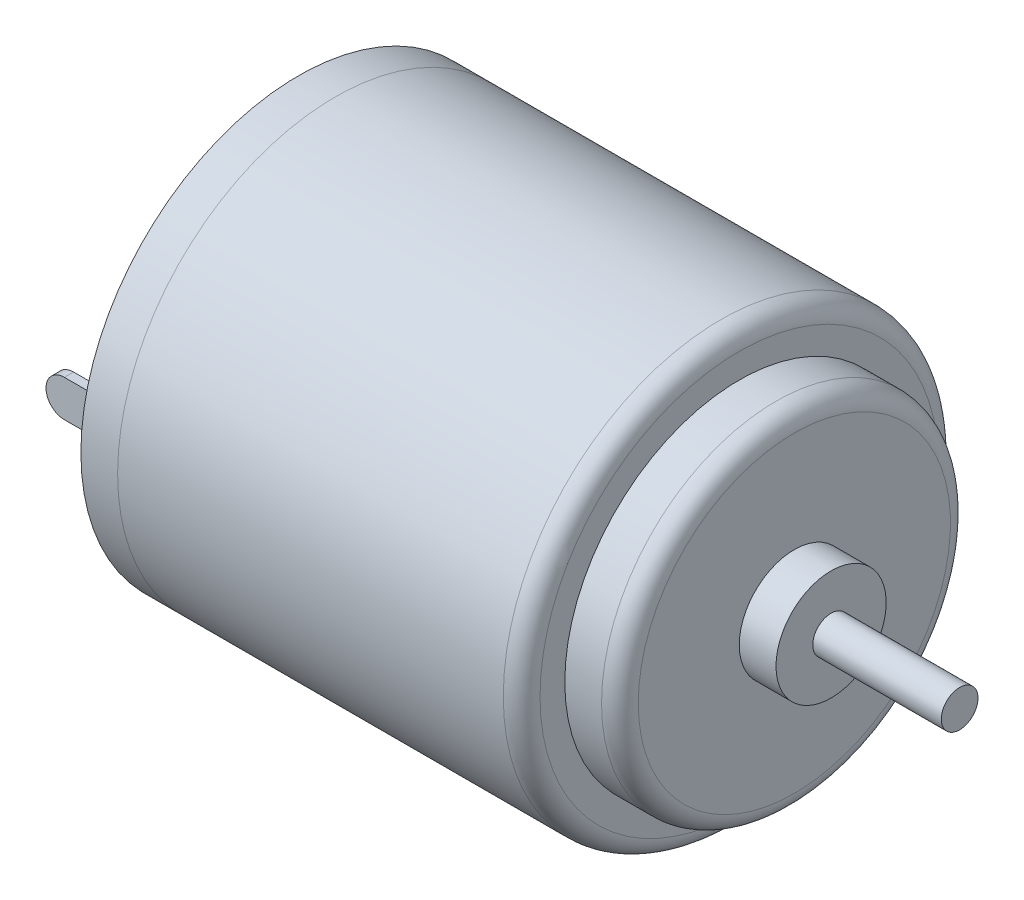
ISO-10303-21;
HEADER;
FILE_DESCRIPTION(('STEP AP214'),'2;1');
FILE_NAME('part.step','',(''),(''),'','','');
FILE_SCHEMA(('AUTOMOTIVE_DESIGN { 1 0 10303 214 1 1 1 1 }'));
ENDSEC;
DATA;
#1=APPLICATION_CONTEXT('core data for automotive mechanical design processes');
#2=APPLICATION_PROTOCOL_DEFINITION('international standard','automotive_design',2000,#1);
#3=PRODUCT_CONTEXT('',#1,'mechanical');
#4=PRODUCT('Part','Part','',(#3));
#5=PRODUCT_RELATED_PRODUCT_CATEGORY('part','',(#4));
#6=PRODUCT_DEFINITION_FORMATION('','',#4);
#7=PRODUCT_DEFINITION_CONTEXT('part definition',#1,'design');
#8=PRODUCT_DEFINITION('design','',#6,#7);
#9=PRODUCT_DEFINITION_SHAPE('','',#8);
#10=(LENGTH_UNIT() NAMED_UNIT(*) SI_UNIT(.MILLI.,.METRE.));
#11=(NAMED_UNIT(*) PLANE_ANGLE_UNIT() SI_UNIT($,.RADIAN.));
#12=(NAMED_UNIT(*) SI_UNIT($,.STERADIAN.) SOLID_ANGLE_UNIT());
#13=UNCERTAINTY_MEASURE_WITH_UNIT(LENGTH_MEASURE(1.E-05),#10,'distance_accuracy_value','');
#14=(GEOMETRIC_REPRESENTATION_CONTEXT(3) GLOBAL_UNCERTAINTY_ASSIGNED_CONTEXT((#13)) GLOBAL_UNIT_ASSIGNED_CONTEXT((#10,
#11,#12)) REPRESENTATION_CONTEXT('',''));
#15=CARTESIAN_POINT('',(0.,0.,0.));
#16=DIRECTION('',(0.,0.,1.));
#17=DIRECTION('',(1.,0.,0.));
#18=AXIS2_PLACEMENT_3D('',#15,#16,#17);
#19=CARTESIAN_POINT('',(34.,0.,0.));
#20=DIRECTION('',(-1.,0.,0.));
#21=DIRECTION('',(0.,0.,1.));
#22=AXIS2_PLACEMENT_3D('',#19,#20,#21);
#23=CYLINDRICAL_SURFACE('',#22,1.);
#24=CARTESIAN_POINT('',(34.,0.,0.));
#25=DIRECTION('',(1.,0.,0.));
#26=DIRECTION('',(0.,0.,-1.));
#27=AXIS2_PLACEMENT_3D('',#24,#25,#26);
#28=CIRCLE('',#27,1.);
#29=CARTESIAN_POINT('',(34.,0.,-1.));
#30=VERTEX_POINT('',#29);
#31=EDGE_CURVE('E11',#30,#30,#28,.T.);
#32=ORIENTED_EDGE('',*,*,#31,.F.);
#33=EDGE_LOOP('',(#32));
#34=FACE_BOUND('',#33,.T.);
#35=CARTESIAN_POINT('',(-5.,0.,0.));
#36=DIRECTION('',(1.,0.,0.));
#37=DIRECTION('',(0.,0.,-1.));
#38=AXIS2_PLACEMENT_3D('',#35,#36,#37);
#39=CIRCLE('',#38,1.);
#40=CARTESIAN_POINT('',(-5.,0.,-1.));
#41=VERTEX_POINT('',#40);
#42=EDGE_CURVE('E45',#41,#41,#39,.T.);
#43=ORIENTED_EDGE('',*,*,#42,.T.);
#44=EDGE_LOOP('',(#43));
#45=FACE_BOUND('',#44,.T.);
#46=ADVANCED_FACE('F39',(#34,#45),#23,.T.);
#47=CARTESIAN_POINT('',(34.,0.,0.));
#48=DIRECTION('',(1.,0.,0.));
#49=DIRECTION('',(0.,0.,-1.));
#50=AXIS2_PLACEMENT_3D('',#47,#48,#49);
#51=PLANE('',#50);
#52=ORIENTED_EDGE('',*,*,#31,.T.);
#53=EDGE_LOOP('',(#52));
#54=FACE_BOUND('',#53,.T.);
#55=ADVANCED_FACE('F54',(#54),#51,.T.);
#56=CARTESIAN_POINT('',(-5.,0.,0.));
#57=DIRECTION('',(1.,0.,0.));
#58=DIRECTION('',(0.,0.,-1.));
#59=AXIS2_PLACEMENT_3D('',#56,#57,#58);
#60=PLANE('',#59);
#61=ORIENTED_EDGE('',*,*,#42,.F.);
#62=EDGE_LOOP('',(#61));
#63=FACE_BOUND('',#62,.T.);
#64=ADVANCED_FACE('F52',(#63),#60,.F.);
#65=CLOSED_SHELL('',(#46,#55,#64));
#66=MANIFOLD_SOLID_BREP('B2',#65);
#67=CARTESIAN_POINT('',(0.,0.,0.));
#68=DIRECTION('',(-1.,0.,0.));
#69=DIRECTION('',(0.,0.,1.));
#70=AXIS2_PLACEMENT_3D('',#67,#68,#69);
#71=PLANE('',#70);
#72=CARTESIAN_POINT('',(0.,0.,0.));
#73=DIRECTION('',(-1.,0.,0.));
#74=DIRECTION('',(0.,0.,1.));
#75=AXIS2_PLACEMENT_3D('',#72,#73,#74);
#76=CIRCLE('',#75,11.85);
#77=CARTESIAN_POINT('',(0.,0.,11.85));
#78=VERTEX_POINT('',#77);
#79=EDGE_CURVE('E37',#78,#78,#76,.T.);
#80=ORIENTED_EDGE('',*,*,#79,.F.);
#81=EDGE_LOOP('',(#80));
#82=FACE_BOUND('',#81,.T.);
#83=ADVANCED_FACE('F86',(#82),#71,.F.);
#84=CARTESIAN_POINT('',(-4.,0.,0.));
#85=DIRECTION('',(-1.,0.,0.));
#86=DIRECTION('',(0.,0.,1.));
#87=AXIS2_PLACEMENT_3D('',#84,#85,#86);
#88=CYLINDRICAL_SURFACE('',#87,11.85);
#89=CARTESIAN_POINT('',(-2.,0.,0.));
#90=DIRECTION('',(-1.,0.,0.));
#91=DIRECTION('',(0.,0.,1.));
#92=AXIS2_PLACEMENT_3D('',#89,#90,#91);
#93=CIRCLE('',#92,11.85);
#94=CARTESIAN_POINT('',(-2.,0.,11.85));
#95=VERTEX_POINT('',#94);
#96=EDGE_CURVE('E93',#95,#95,#93,.T.);
#97=ORIENTED_EDGE('',*,*,#96,.F.);
#98=EDGE_LOOP('',(#97));
#99=FACE_BOUND('',#98,.T.);
#100=ORIENTED_EDGE('',*,*,#79,.T.);
#101=EDGE_LOOP('',(#100));
#102=FACE_BOUND('',#101,.T.);
#103=ADVANCED_FACE('F226',(#99,#102),#88,.T.);
#104=CARTESIAN_POINT('',(-2.,11.85,0.));
#105=DIRECTION('',(1.,0.,0.));
#106=DIRECTION('',(0.,0.,-1.));
#107=AXIS2_PLACEMENT_3D('',#104,#105,#106);
#108=PLANE('',#107);
#109=DIRECTION('',(0.,0.,1.));
#110=VECTOR('',#109,1.);
#111=CARTESIAN_POINT('',(-2.,-1.,-9.75));
#112=LINE('',#111,#110);
#113=CARTESIAN_POINT('',(-2.,-1.,-9.75));
#114=VERTEX_POINT('',#113);
#115=CARTESIAN_POINT('',(-2.,-1.,-9.25));
#116=VERTEX_POINT('',#115);
#117=EDGE_CURVE('E100',#114,#116,#112,.T.);
#118=ORIENTED_EDGE('',*,*,#117,.F.);
#119=DIRECTION('',(0.,1.,0.));
#120=VECTOR('',#119,1.);
#121=CARTESIAN_POINT('',(-2.,-1.,-9.75));
#122=LINE('',#121,#120);
#123=CARTESIAN_POINT('',(-2.,0.999999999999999,-9.75));
#124=VERTEX_POINT('',#123);
#125=EDGE_CURVE('E104',#114,#124,#122,.T.);
#126=ORIENTED_EDGE('',*,*,#125,.T.);
#127=DIRECTION('',(0.,0.,1.));
#128=VECTOR('',#127,1.);
#129=CARTESIAN_POINT('',(-2.,1.,-9.75));
#130=LINE('',#129,#128);
#131=CARTESIAN_POINT('',(-2.,1.,-9.25));
#132=VERTEX_POINT('',#131);
#133=EDGE_CURVE('E182',#124,#132,#130,.T.);
#134=ORIENTED_EDGE('',*,*,#133,.T.);
#135=DIRECTION('',(0.,1.,0.));
#136=VECTOR('',#135,1.);
#137=CARTESIAN_POINT('',(-2.,-1.,-9.25));
#138=LINE('',#137,#136);
#139=EDGE_CURVE('E166',#116,#132,#138,.T.);
#140=ORIENTED_EDGE('',*,*,#139,.F.);
#141=EDGE_LOOP('',(#118,#126,#134,#140));
#142=FACE_BOUND('',#141,.T.);
#143=DIRECTION('',(0.,0.,-1.));
#144=VECTOR('',#143,1.);
#145=CARTESIAN_POINT('',(-2.,1.,9.75));
#146=LINE('',#145,#144);
#147=CARTESIAN_POINT('',(-2.,0.999999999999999,9.75));
#148=VERTEX_POINT('',#147);
#149=CARTESIAN_POINT('',(-2.,0.999999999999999,9.25));
#150=VERTEX_POINT('',#149);
#151=EDGE_CURVE('E213',#148,#150,#146,.T.);
#152=ORIENTED_EDGE('',*,*,#151,.F.);
#153=DIRECTION('',(0.,1.,0.));
#154=VECTOR('',#153,1.);
#155=CARTESIAN_POINT('',(-2.,-1.,9.75));
#156=LINE('',#155,#154);
#157=CARTESIAN_POINT('',(-2.,-1.,9.75));
#158=VERTEX_POINT('',#157);
#159=EDGE_CURVE('E195',#158,#148,#156,.T.);
#160=ORIENTED_EDGE('',*,*,#159,.F.);
#161=DIRECTION('',(0.,0.,-1.));
#162=VECTOR('',#161,1.);
#163=CARTESIAN_POINT('',(-2.,-1.,9.75));
#164=LINE('',#163,#162);
#165=CARTESIAN_POINT('',(-2.,-1.,9.25));
#166=VERTEX_POINT('',#165);
#167=EDGE_CURVE('E205',#158,#166,#164,.T.);
#168=ORIENTED_EDGE('',*,*,#167,.T.);
#169=DIRECTION('',(0.,1.,0.));
#170=VECTOR('',#169,1.);
#171=CARTESIAN_POINT('',(-2.,-1.,9.25));
#172=LINE('',#171,#170);
#173=EDGE_CURVE('E186',#166,#150,#172,.T.);
#174=ORIENTED_EDGE('',*,*,#173,.T.);
#175=EDGE_LOOP('',(#152,#160,#168,#174));
#176=FACE_BOUND('',#175,.T.);
#177=CARTESIAN_POINT('',(-2.,0.,0.));
#178=DIRECTION('',(-1.,0.,0.));
#179=DIRECTION('',(0.,0.,1.));
#180=AXIS2_PLACEMENT_3D('',#177,#178,#179);
#181=CIRCLE('',#180,4.25);
#182=CARTESIAN_POINT('',(-2.,0.,4.25));
#183=VERTEX_POINT('',#182);
#184=EDGE_CURVE('E219',#183,#183,#181,.T.);
#185=ORIENTED_EDGE('',*,*,#184,.F.);
#186=EDGE_LOOP('',(#185));
#187=FACE_BOUND('',#186,.T.);
#188=ORIENTED_EDGE('',*,*,#96,.T.);
#189=EDGE_LOOP('',(#188));
#190=FACE_BOUND('',#189,.T.);
#191=ADVANCED_FACE('F224',(#142,#176,#187,#190),#108,.F.);
#192=CARTESIAN_POINT('',(-4.,0.,0.));
#193=DIRECTION('',(-1.,0.,0.));
#194=DIRECTION('',(0.,0.,1.));
#195=AXIS2_PLACEMENT_3D('',#192,#193,#194);
#196=CYLINDRICAL_SURFACE('',#195,4.25);
#197=CARTESIAN_POINT('',(-4.,0.,0.));
#198=DIRECTION('',(-1.,0.,0.));
#199=DIRECTION('',(0.,0.,1.));
#200=AXIS2_PLACEMENT_3D('',#197,#198,#199);
#201=CIRCLE('',#200,4.25);
#202=CARTESIAN_POINT('',(-4.,0.,4.25));
#203=VERTEX_POINT('',#202);
#204=EDGE_CURVE('E216',#203,#203,#201,.T.);
#205=ORIENTED_EDGE('',*,*,#204,.F.);
#206=EDGE_LOOP('',(#205));
#207=FACE_BOUND('',#206,.T.);
#208=ORIENTED_EDGE('',*,*,#184,.T.);
#209=EDGE_LOOP('',(#208));
#210=FACE_BOUND('',#209,.T.);
#211=ADVANCED_FACE('F245',(#207,#210),#196,.T.);
#212=CARTESIAN_POINT('',(-4.,4.25,0.));
#213=DIRECTION('',(1.,0.,0.));
#214=DIRECTION('',(0.,0.,-1.));
#215=AXIS2_PLACEMENT_3D('',#212,#213,#214);
#216=PLANE('',#215);
#217=ORIENTED_EDGE('',*,*,#204,.T.);
#218=EDGE_LOOP('',(#217));
#219=FACE_BOUND('',#218,.T.);
#220=ADVANCED_FACE('F253',(#219),#216,.F.);
#221=CARTESIAN_POINT('',(-2.,1.,9.75));
#222=DIRECTION('',(0.,-1.,0.));
#223=DIRECTION('',(1.,0.,0.));
#224=AXIS2_PLACEMENT_3D('',#221,#222,#223);
#225=PLANE('',#224);
#226=DIRECTION('',(-1.,0.,0.));
#227=VECTOR('',#226,1.);
#228=CARTESIAN_POINT('',(-2.,1.,9.25));
#229=LINE('',#228,#227);
#230=CARTESIAN_POINT('',(-5.,0.999999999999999,9.25));
#231=VERTEX_POINT('',#230);
#232=EDGE_CURVE('E188',#150,#231,#229,.T.);
#233=ORIENTED_EDGE('',*,*,#232,.T.);
#234=DIRECTION('',(0.,0.,-1.));
#235=VECTOR('',#234,1.);
#236=CARTESIAN_POINT('',(-5.,0.999999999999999,9.75));
#237=LINE('',#236,#235);
#238=CARTESIAN_POINT('',(-5.,0.999999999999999,9.75));
#239=VERTEX_POINT('',#238);
#240=EDGE_CURVE('E210',#239,#231,#237,.T.);
#241=ORIENTED_EDGE('',*,*,#240,.F.);
#242=DIRECTION('',(-1.,0.,0.));
#243=VECTOR('',#242,1.);
#244=CARTESIAN_POINT('',(-2.,1.,9.75));
#245=LINE('',#244,#243);
#246=EDGE_CURVE('E198',#148,#239,#245,.T.);
#247=ORIENTED_EDGE('',*,*,#246,.F.);
#248=ORIENTED_EDGE('',*,*,#151,.T.);
#249=EDGE_LOOP('',(#233,#241,#247,#248));
#250=FACE_BOUND('',#249,.T.);
#251=ADVANCED_FACE('F261',(#250),#225,.F.);
#252=CARTESIAN_POINT('',(-5.,0.,9.75));
#253=DIRECTION('',(0.,0.,-1.));
#254=DIRECTION('',(-1.,0.,0.));
#255=AXIS2_PLACEMENT_3D('',#252,#253,#254);
#256=CYLINDRICAL_SURFACE('',#255,1.);
#257=CARTESIAN_POINT('',(-5.,0.,9.25));
#258=DIRECTION('',(0.,0.,1.));
#259=DIRECTION('',(1.,0.,0.));
#260=AXIS2_PLACEMENT_3D('',#257,#258,#259);
#261=CIRCLE('',#260,1.);
#262=CARTESIAN_POINT('',(-5.,-1.,9.25));
#263=VERTEX_POINT('',#262);
#264=EDGE_CURVE('E190',#231,#263,#261,.T.);
#265=ORIENTED_EDGE('',*,*,#264,.T.);
#266=DIRECTION('',(0.,0.,-1.));
#267=VECTOR('',#266,1.);
#268=CARTESIAN_POINT('',(-5.,-1.,9.75));
#269=LINE('',#268,#267);
#270=CARTESIAN_POINT('',(-5.,-1.,9.75));
#271=VERTEX_POINT('',#270);
#272=EDGE_CURVE('E207',#271,#263,#269,.T.);
#273=ORIENTED_EDGE('',*,*,#272,.F.);
#274=CARTESIAN_POINT('',(-5.,0.,9.75));
#275=DIRECTION('',(0.,0.,1.));
#276=DIRECTION('',(1.,0.,0.));
#277=AXIS2_PLACEMENT_3D('',#274,#275,#276);
#278=CIRCLE('',#277,1.);
#279=EDGE_CURVE('E200',#239,#271,#278,.T.);
#280=ORIENTED_EDGE('',*,*,#279,.F.);
#281=ORIENTED_EDGE('',*,*,#240,.T.);
#282=EDGE_LOOP('',(#265,#273,#280,#281));
#283=FACE_BOUND('',#282,.T.);
#284=ADVANCED_FACE('F269',(#283),#256,.T.);
#285=CARTESIAN_POINT('',(-2.,-1.,9.75));
#286=DIRECTION('',(0.,1.,0.));
#287=DIRECTION('',(-1.,0.,0.));
#288=AXIS2_PLACEMENT_3D('',#285,#286,#287);
#289=PLANE('',#288);
#290=DIRECTION('',(1.,0.,0.));
#291=VECTOR('',#290,1.);
#292=CARTESIAN_POINT('',(-2.,-1.,9.25));
#293=LINE('',#292,#291);
#294=EDGE_CURVE('E192',#263,#166,#293,.T.);
#295=ORIENTED_EDGE('',*,*,#294,.T.);
#296=ORIENTED_EDGE('',*,*,#167,.F.);
#297=DIRECTION('',(1.,0.,0.));
#298=VECTOR('',#297,1.);
#299=CARTESIAN_POINT('',(-2.,-1.,9.75));
#300=LINE('',#299,#298);
#301=EDGE_CURVE('E202',#271,#158,#300,.T.);
#302=ORIENTED_EDGE('',*,*,#301,.F.);
#303=ORIENTED_EDGE('',*,*,#272,.T.);
#304=EDGE_LOOP('',(#295,#296,#302,#303));
#305=FACE_BOUND('',#304,.T.);
#306=ADVANCED_FACE('F277',(#305),#289,.F.);
#307=CARTESIAN_POINT('',(-5.,0.,9.75));
#308=DIRECTION('',(0.,0.,1.));
#309=DIRECTION('',(1.,0.,0.));
#310=AXIS2_PLACEMENT_3D('',#307,#308,#309);
#311=PLANE('',#310);
#312=ORIENTED_EDGE('',*,*,#159,.T.);
#313=ORIENTED_EDGE('',*,*,#246,.T.);
#314=ORIENTED_EDGE('',*,*,#279,.T.);
#315=ORIENTED_EDGE('',*,*,#301,.T.);
#316=EDGE_LOOP('',(#312,#313,#314,#315));
#317=FACE_BOUND('',#316,.T.);
#318=ADVANCED_FACE('F285',(#317),#311,.T.);
#319=CARTESIAN_POINT('',(-5.,0.,9.25));
#320=DIRECTION('',(0.,0.,1.));
#321=DIRECTION('',(1.,0.,0.));
#322=AXIS2_PLACEMENT_3D('',#319,#320,#321);
#323=PLANE('',#322);
#324=ORIENTED_EDGE('',*,*,#173,.F.);
#325=ORIENTED_EDGE('',*,*,#294,.F.);
#326=ORIENTED_EDGE('',*,*,#264,.F.);
#327=ORIENTED_EDGE('',*,*,#232,.F.);
#328=EDGE_LOOP('',(#324,#325,#326,#327));
#329=FACE_BOUND('',#328,.T.);
#330=ADVANCED_FACE('F293',(#329),#323,.F.);
#331=CARTESIAN_POINT('',(-2.,-1.,-9.75));
#332=DIRECTION('',(0.,-1.,0.));
#333=DIRECTION('',(1.,0.,0.));
#334=AXIS2_PLACEMENT_3D('',#331,#332,#333);
#335=PLANE('',#334);
#336=DIRECTION('',(1.,0.,0.));
#337=VECTOR('',#336,1.);
#338=CARTESIAN_POINT('',(-2.,-1.,-9.25));
#339=LINE('',#338,#337);
#340=CARTESIAN_POINT('',(-5.,-1.,-9.25));
#341=VERTEX_POINT('',#340);
#342=EDGE_CURVE('E162',#341,#116,#339,.T.);
#343=ORIENTED_EDGE('',*,*,#342,.F.);
#344=DIRECTION('',(0.,0.,1.));
#345=VECTOR('',#344,1.);
#346=CARTESIAN_POINT('',(-5.,-1.,-9.75));
#347=LINE('',#346,#345);
#348=CARTESIAN_POINT('',(-5.,-1.,-9.75));
#349=VERTEX_POINT('',#348);
#350=EDGE_CURVE('E148',#349,#341,#347,.T.);
#351=ORIENTED_EDGE('',*,*,#350,.F.);
#352=DIRECTION('',(1.,0.,0.));
#353=VECTOR('',#352,1.);
#354=CARTESIAN_POINT('',(-2.,-1.,-9.75));
#355=LINE('',#354,#353);
#356=EDGE_CURVE('E176',#349,#114,#355,.T.);
#357=ORIENTED_EDGE('',*,*,#356,.T.);
#358=ORIENTED_EDGE('',*,*,#117,.T.);
#359=EDGE_LOOP('',(#343,#351,#357,#358));
#360=FACE_BOUND('',#359,.T.);
#361=ADVANCED_FACE('F163',(#360),#335,.T.);
#362=CARTESIAN_POINT('',(-5.,0.,-9.75));
#363=DIRECTION('',(0.,0.,1.));
#364=DIRECTION('',(1.,0.,0.));
#365=AXIS2_PLACEMENT_3D('',#362,#363,#364);
#366=CYLINDRICAL_SURFACE('',#365,1.);
#367=CARTESIAN_POINT('',(-5.,0.,-9.25));
#368=DIRECTION('',(0.,0.,1.));
#369=DIRECTION('',(1.,0.,0.));
#370=AXIS2_PLACEMENT_3D('',#367,#368,#369);
#371=CIRCLE('',#370,1.);
#372=CARTESIAN_POINT('',(-5.,0.999999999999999,-9.25));
#373=VERTEX_POINT('',#372);
#374=EDGE_CURVE('E152',#373,#341,#371,.T.);
#375=ORIENTED_EDGE('',*,*,#374,.F.);
#376=DIRECTION('',(0.,0.,1.));
#377=VECTOR('',#376,1.);
#378=CARTESIAN_POINT('',(-5.,0.999999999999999,-9.75));
#379=LINE('',#378,#377);
#380=CARTESIAN_POINT('',(-5.,0.999999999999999,-9.75));
#381=VERTEX_POINT('',#380);
#382=EDGE_CURVE('E159',#381,#373,#379,.T.);
#383=ORIENTED_EDGE('',*,*,#382,.F.);
#384=CARTESIAN_POINT('',(-5.,0.,-9.75));
#385=DIRECTION('',(0.,0.,1.));
#386=DIRECTION('',(1.,0.,0.));
#387=AXIS2_PLACEMENT_3D('',#384,#385,#386);
#388=CIRCLE('',#387,1.);
#389=EDGE_CURVE('E155',#381,#349,#388,.T.);
#390=ORIENTED_EDGE('',*,*,#389,.T.);
#391=ORIENTED_EDGE('',*,*,#350,.T.);
#392=EDGE_LOOP('',(#375,#383,#390,#391));
#393=FACE_BOUND('',#392,.T.);
#394=ADVANCED_FACE('F150',(#393),#366,.T.);
#395=CARTESIAN_POINT('',(-2.,1.,-9.75));
#396=DIRECTION('',(0.,1.,0.));
#397=DIRECTION('',(-1.,0.,0.));
#398=AXIS2_PLACEMENT_3D('',#395,#396,#397);
#399=PLANE('',#398);
#400=DIRECTION('',(-1.,0.,0.));
#401=VECTOR('',#400,1.);
#402=CARTESIAN_POINT('',(-2.,1.,-9.25));
#403=LINE('',#402,#401);
#404=EDGE_CURVE('E170',#132,#373,#403,.T.);
#405=ORIENTED_EDGE('',*,*,#404,.F.);
#406=ORIENTED_EDGE('',*,*,#133,.F.);
#407=DIRECTION('',(-1.,0.,0.));
#408=VECTOR('',#407,1.);
#409=CARTESIAN_POINT('',(-2.,1.,-9.75));
#410=LINE('',#409,#408);
#411=EDGE_CURVE('E179',#124,#381,#410,.T.);
#412=ORIENTED_EDGE('',*,*,#411,.T.);
#413=ORIENTED_EDGE('',*,*,#382,.T.);
#414=EDGE_LOOP('',(#405,#406,#412,#413));
#415=FACE_BOUND('',#414,.T.);
#416=ADVANCED_FACE('F312',(#415),#399,.T.);
#417=CARTESIAN_POINT('',(-5.,0.,-9.75));
#418=DIRECTION('',(0.,0.,-1.));
#419=DIRECTION('',(1.,0.,0.));
#420=AXIS2_PLACEMENT_3D('',#417,#418,#419);
#421=PLANE('',#420);
#422=ORIENTED_EDGE('',*,*,#125,.F.);
#423=ORIENTED_EDGE('',*,*,#356,.F.);
#424=ORIENTED_EDGE('',*,*,#389,.F.);
#425=ORIENTED_EDGE('',*,*,#411,.F.);
#426=EDGE_LOOP('',(#422,#423,#424,#425));
#427=FACE_BOUND('',#426,.T.);
#428=ADVANCED_FACE('F319',(#427),#421,.T.);
#429=CARTESIAN_POINT('',(-5.,0.,-9.25));
#430=DIRECTION('',(0.,0.,-1.));
#431=DIRECTION('',(1.,0.,0.));
#432=AXIS2_PLACEMENT_3D('',#429,#430,#431);
#433=PLANE('',#432);
#434=ORIENTED_EDGE('',*,*,#139,.T.);
#435=ORIENTED_EDGE('',*,*,#404,.T.);
#436=ORIENTED_EDGE('',*,*,#374,.T.);
#437=ORIENTED_EDGE('',*,*,#342,.T.);
#438=EDGE_LOOP('',(#434,#435,#436,#437));
#439=FACE_BOUND('',#438,.T.);
#440=ADVANCED_FACE('F168',(#439),#433,.F.);
#441=CLOSED_SHELL('',(#83,#103,#191,#211,#220,#251,#284,#306,#318,#330,#361,#394,#416,#428,#440));
#442=MANIFOLD_SOLID_BREP('B6',#441);
#443=CARTESIAN_POINT('',(0.,11.85,0.));
#444=DIRECTION('',(1.,0.,0.));
#445=DIRECTION('',(0.,0.,-1.));
#446=AXIS2_PLACEMENT_3D('',#443,#444,#445);
#447=PLANE('',#446);
#448=CARTESIAN_POINT('',(0.,0.,0.));
#449=DIRECTION('',(-1.,0.,0.));
#450=DIRECTION('',(0.,0.,1.));
#451=AXIS2_PLACEMENT_3D('',#448,#449,#450);
#452=CIRCLE('',#451,11.85);
#453=CARTESIAN_POINT('',(0.,0.,11.85));
#454=VERTEX_POINT('',#453);
#455=EDGE_CURVE('E403',#454,#454,#452,.T.);
#456=ORIENTED_EDGE('',*,*,#455,.T.);
#457=EDGE_LOOP('',(#456));
#458=FACE_BOUND('',#457,.T.);
#459=ADVANCED_FACE('F384',(#458),#447,.F.);
#460=CARTESIAN_POINT('',(0.,0.,0.));
#461=DIRECTION('',(-1.,0.,0.));
#462=DIRECTION('',(0.,0.,1.));
#463=AXIS2_PLACEMENT_3D('',#460,#461,#462);
#464=CYLINDRICAL_SURFACE('',#463,11.85);
#465=CARTESIAN_POINT('',(21.,0.,0.));
#466=DIRECTION('',(-1.,0.,0.));
#467=DIRECTION('',(0.,0.,1.));
#468=AXIS2_PLACEMENT_3D('',#465,#466,#467);
#469=CIRCLE('',#468,11.85);
#470=CARTESIAN_POINT('',(21.,0.,11.85));
#471=VERTEX_POINT('',#470);
#472=EDGE_CURVE('E398',#471,#471,#469,.T.);
#473=ORIENTED_EDGE('',*,*,#472,.T.);
#474=EDGE_LOOP('',(#473));
#475=FACE_BOUND('',#474,.T.);
#476=ORIENTED_EDGE('',*,*,#455,.F.);
#477=EDGE_LOOP('',(#476));
#478=FACE_BOUND('',#477,.T.);
#479=ADVANCED_FACE('F433',(#475,#478),#464,.T.);
#480=CARTESIAN_POINT('',(22.,9.5,0.));
#481=DIRECTION('',(-1.,0.,0.));
#482=DIRECTION('',(0.,0.,1.));
#483=AXIS2_PLACEMENT_3D('',#480,#481,#482);
#484=PLANE('',#483);
#485=CARTESIAN_POINT('',(22.,0.,0.));
#486=DIRECTION('',(-1.,0.,0.));
#487=DIRECTION('',(0.,0.,1.));
#488=AXIS2_PLACEMENT_3D('',#485,#486,#487);
#489=CIRCLE('',#488,10.85);
#490=CARTESIAN_POINT('',(22.,0.,10.85));
#491=VERTEX_POINT('',#490);
#492=EDGE_CURVE('E394',#491,#491,#489,.F.);
#493=ORIENTED_EDGE('',*,*,#492,.T.);
#494=EDGE_LOOP('',(#493));
#495=FACE_BOUND('',#494,.T.);
#496=CARTESIAN_POINT('',(22.,0.,0.));
#497=DIRECTION('',(-1.,0.,0.));
#498=DIRECTION('',(0.,0.,1.));
#499=AXIS2_PLACEMENT_3D('',#496,#497,#498);
#500=CIRCLE('',#499,9.5);
#501=CARTESIAN_POINT('',(22.,0.,9.5));
#502=VERTEX_POINT('',#501);
#503=EDGE_CURVE('E406',#502,#502,#500,.T.);
#504=ORIENTED_EDGE('',*,*,#503,.T.);
#505=EDGE_LOOP('',(#504));
#506=FACE_BOUND('',#505,.T.);
#507=ADVANCED_FACE('F438',(#495,#506),#484,.F.);
#508=CARTESIAN_POINT('',(0.,0.,0.));
#509=DIRECTION('',(-1.,0.,0.));
#510=DIRECTION('',(0.,0.,1.));
#511=AXIS2_PLACEMENT_3D('',#508,#509,#510);
#512=CYLINDRICAL_SURFACE('',#511,9.5);
#513=CARTESIAN_POINT('',(24.,0.,0.));
#514=DIRECTION('',(-1.,0.,0.));
#515=DIRECTION('',(0.,0.,1.));
#516=AXIS2_PLACEMENT_3D('',#513,#514,#515);
#517=CIRCLE('',#516,9.5);
#518=CARTESIAN_POINT('',(24.,0.,9.5));
#519=VERTEX_POINT('',#518);
#520=EDGE_CURVE('E390',#519,#519,#517,.T.);
#521=ORIENTED_EDGE('',*,*,#520,.T.);
#522=EDGE_LOOP('',(#521));
#523=FACE_BOUND('',#522,.T.);
#524=ORIENTED_EDGE('',*,*,#503,.F.);
#525=EDGE_LOOP('',(#524));
#526=FACE_BOUND('',#525,.T.);
#527=ADVANCED_FACE('F445',(#523,#526),#512,.T.);
#528=CARTESIAN_POINT('',(25.,2.99999999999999,0.));
#529=DIRECTION('',(-1.,0.,0.));
#530=DIRECTION('',(0.,0.,1.));
#531=AXIS2_PLACEMENT_3D('',#528,#529,#530);
#532=PLANE('',#531);
#533=CARTESIAN_POINT('',(25.,0.,0.));
#534=DIRECTION('',(-1.,0.,0.));
#535=DIRECTION('',(0.,0.,1.));
#536=AXIS2_PLACEMENT_3D('',#533,#534,#535);
#537=CIRCLE('',#536,8.5);
#538=CARTESIAN_POINT('',(25.,0.,8.5));
#539=VERTEX_POINT('',#538);
#540=EDGE_CURVE('E85',#539,#539,#537,.F.);
#541=ORIENTED_EDGE('',*,*,#540,.T.);
#542=EDGE_LOOP('',(#541));
#543=FACE_BOUND('',#542,.T.);
#544=CARTESIAN_POINT('',(25.,0.,0.));
#545=DIRECTION('',(-1.,0.,0.));
#546=DIRECTION('',(0.,0.,1.));
#547=AXIS2_PLACEMENT_3D('',#544,#545,#546);
#548=CIRCLE('',#547,2.99999999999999);
#549=CARTESIAN_POINT('',(25.,0.,2.99999999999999));
#550=VERTEX_POINT('',#549);
#551=EDGE_CURVE('E409',#550,#550,#548,.T.);
#552=ORIENTED_EDGE('',*,*,#551,.T.);
#553=EDGE_LOOP('',(#552));
#554=FACE_BOUND('',#553,.T.);
#555=ADVANCED_FACE('F429',(#543,#554),#532,.F.);
#556=CARTESIAN_POINT('',(0.,0.,0.));
#557=DIRECTION('',(-1.,0.,0.));
#558=DIRECTION('',(0.,0.,1.));
#559=AXIS2_PLACEMENT_3D('',#556,#557,#558);
#560=CYLINDRICAL_SURFACE('',#559,2.99999999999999);
#561=ORIENTED_EDGE('',*,*,#551,.F.);
#562=EDGE_LOOP('',(#561));
#563=FACE_BOUND('',#562,.T.);
#564=CARTESIAN_POINT('',(27.,0.,0.));
#565=DIRECTION('',(-1.,0.,0.));
#566=DIRECTION('',(0.,0.,1.));
#567=AXIS2_PLACEMENT_3D('',#564,#565,#566);
#568=CIRCLE('',#567,2.99999999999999);
#569=CARTESIAN_POINT('',(27.,0.,2.99999999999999));
#570=VERTEX_POINT('',#569);
#571=EDGE_CURVE('E412',#570,#570,#568,.T.);
#572=ORIENTED_EDGE('',*,*,#571,.T.);
#573=EDGE_LOOP('',(#572));
#574=FACE_BOUND('',#573,.T.);
#575=ADVANCED_FACE('F416',(#563,#574),#560,.T.);
#576=CARTESIAN_POINT('',(27.,0.,0.));
#577=DIRECTION('',(-1.,0.,0.));
#578=DIRECTION('',(0.,0.,1.));
#579=AXIS2_PLACEMENT_3D('',#576,#577,#578);
#580=PLANE('',#579);
#581=ORIENTED_EDGE('',*,*,#571,.F.);
#582=EDGE_LOOP('',(#581));
#583=FACE_BOUND('',#582,.T.);
#584=ADVANCED_FACE('F418',(#583),#580,.F.);
#585=CARTESIAN_POINT('',(21.,0.,0.));
#586=DIRECTION('',(-1.,0.,0.));
#587=DIRECTION('',(0.,0.,1.));
#588=AXIS2_PLACEMENT_3D('',#585,#586,#587);
#589=TOROIDAL_SURFACE('',#588,10.85,1.);
#590=ORIENTED_EDGE('',*,*,#492,.F.);
#591=EDGE_LOOP('',(#590));
#592=FACE_BOUND('',#591,.T.);
#593=ORIENTED_EDGE('',*,*,#472,.F.);
#594=EDGE_LOOP('',(#593));
#595=FACE_BOUND('',#594,.T.);
#596=ADVANCED_FACE('F420',(#592,#595),#589,.T.);
#597=CARTESIAN_POINT('',(24.,0.,0.));
#598=DIRECTION('',(-1.,0.,0.));
#599=DIRECTION('',(0.,0.,1.));
#600=AXIS2_PLACEMENT_3D('',#597,#598,#599);
#601=TOROIDAL_SURFACE('',#600,8.5,1.);
#602=ORIENTED_EDGE('',*,*,#540,.F.);
#603=EDGE_LOOP('',(#602));
#604=FACE_BOUND('',#603,.T.);
#605=ORIENTED_EDGE('',*,*,#520,.F.);
#606=EDGE_LOOP('',(#605));
#607=FACE_BOUND('',#606,.T.);
#608=ADVANCED_FACE('F426',(#604,#607),#601,.T.);
#609=CLOSED_SHELL('',(#459,#479,#507,#527,#555,#575,#584,#596,#608));
#610=MANIFOLD_SOLID_BREP('B31',#609);
#611=ADVANCED_BREP_SHAPE_REPRESENTATION('',(#18,#66,#442,#610),#14);
#612=SHAPE_DEFINITION_REPRESENTATION(#9,#611);
ENDSEC;
END-ISO-10303-21;
